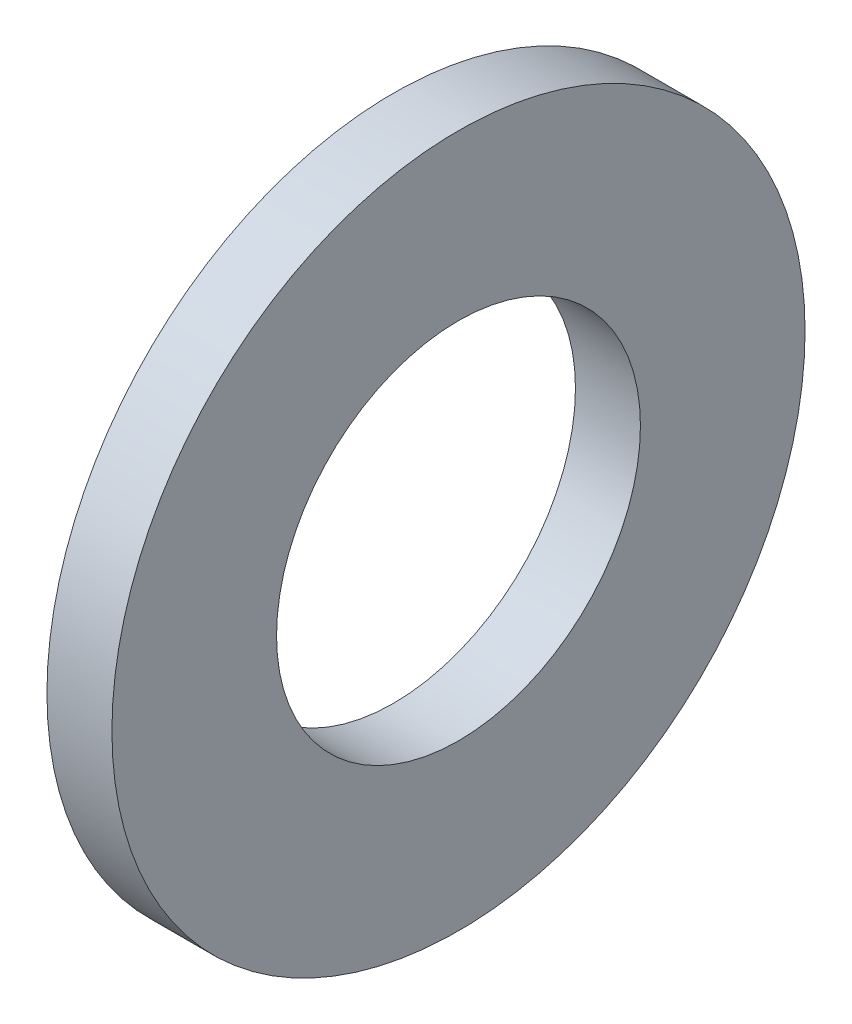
from build123d import *

# Parameters (mm, degrees)
ESQUISSE1_W = 1.5
ESQUISSE1_H = 3.8


with BuildPart() as part:
    # Esquisse1 → Base-R_volution (revolve)
    with BuildSketch(Plane(origin=(0, 0, 0), x_dir=(1, 0, 0), z_dir=(0, 1, 0)), mode=Mode.PRIVATE) as base_r_volution_sk:
        with Locations((0.75, 6.1)):
            Rectangle(ESQUISSE1_W, ESQUISSE1_H)
    revolve(base_r_volution_sk.sketch.rotate(Axis((0, 0, 0), (1, 0, 0)), 180), axis=Axis((0, 0, 0), (1, 0, 0)))


solid = part.part
